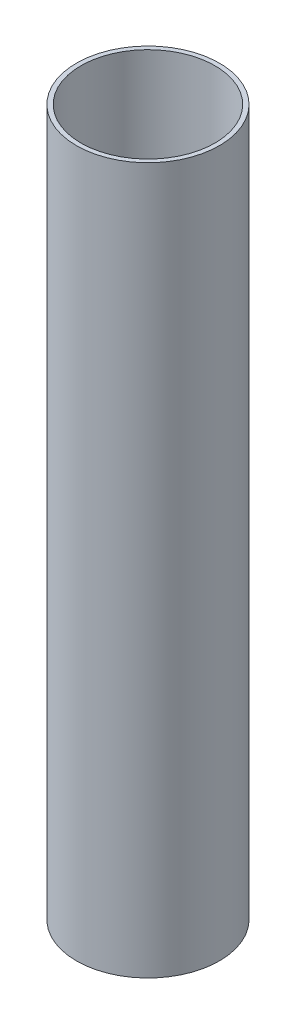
from build123d import *

# Parameters (mm, degrees)
SKETCH1_R      = 50.8
SKETCH1_R_2    = 47.625
EXTRUDE1_DEPTH = 501.65


with BuildPart() as part:
    # Sketch1 → Extrude1 (new body)
    with BuildSketch(Plane(origin=(0, 0, 0), x_dir=(1, 0, 0), z_dir=(0, 1, 0))):
        with Locations(Location((0, 0, 0), (0, 0, 270))):
            Circle(SKETCH1_R)
        with Locations(Location((0, 0, 0), (0, 0, 270))):
            Circle(SKETCH1_R_2, mode=Mode.SUBTRACT)
    extrude(amount=-EXTRUDE1_DEPTH)


solid = part.part
